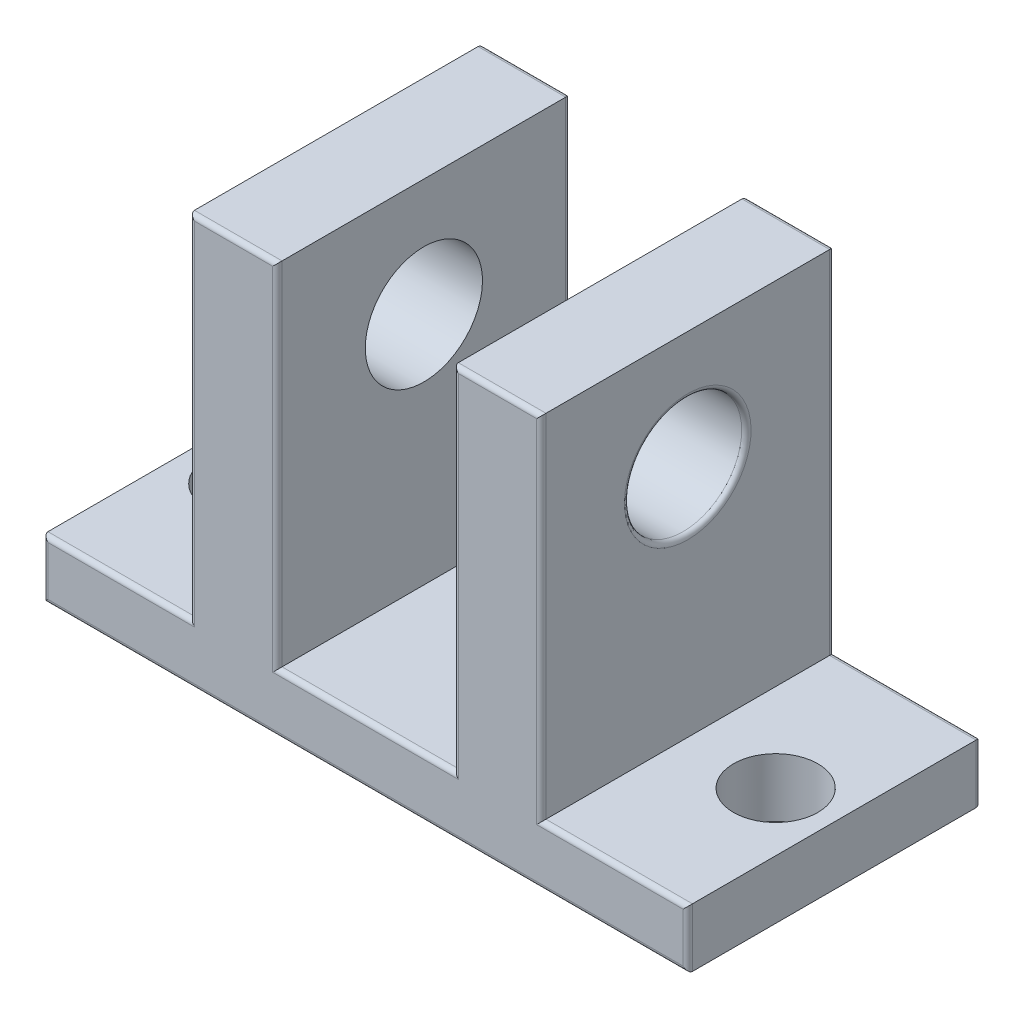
from build123d import *

# Parameters (mm, degrees)
BASE_EXTRUDE_DEPTH = 15.875
SKETCH2_R          = 3.175
CUT_EXTRUDE1_DEPTH = 39.396502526
SKETCH3_R          = 2.286
CUT_EXTRUDE3_DEPTH = 33.417667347
FILLET1_R          = 0.254


with BuildPart() as part:
    # Sketch1 → Base-Extrude (new body)
    with BuildSketch(Plane.XY):
        Polygon((-17.4625, 0), (17.4625, 0), (17.4625, 3.175), (9.525, 3.175), (9.525, 22.225), (4.7752, 22.225), (4.7752, 3.175), (-4.7752, 3.175), (-4.7752, 22.225), (-9.525, 22.225), (-9.525, 3.175), (-17.4625, 3.175), align=None)
    extrude(amount=BASE_EXTRUDE_DEPTH)

    # Sketch2 → Cut-Extrude1 (cut, through all)
    with BuildSketch(Plane(origin=(9.525, 0, 0), x_dir=(0, 0, -1), z_dir=(1, 0, 0))):
        with Locations(Location((-7.9375, 15.875, 0), (0, 0, 90))):
            Circle(SKETCH2_R)
    extrude(amount=-CUT_EXTRUDE1_DEPTH, mode=Mode.SUBTRACT)

    # Sketch3 → Cut-Extrude3 (cut, through all)
    with BuildSketch(Plane(origin=(0, 0, 0), x_dir=(1, 0, 0), z_dir=(0, 1, 0))):
        with Locations((-14.2875, -7.9375)):
            Circle(SKETCH3_R)
        with Locations((14.2875, -7.9375)):
            Circle(SKETCH3_R)
    extrude(amount=CUT_EXTRUDE3_DEPTH, mode=Mode.SUBTRACT)

    # Fillet1
    fillet1_edges = [part.edges().sort_by_distance(p)[0] for p in [
        (0, 0, 0),
        (0, 0, 15.875),
        (-17.4625, 1.5875, 0),
        (-17.4625, 1.5875, 15.875),
        (17.4625, 1.5875, 0),
        (13.49375, 3.175, 0),
        (9.525, 12.7, 0),
        (7.1501, 22.225, 0),
        (4.7752, 12.7, 0),
        (0, 3.175, 0),
        (-4.7752, 12.7, 0),
        (-7.1501, 22.225, 0),
        (-9.525, 12.7, 0),
        (-13.49375, 3.175, 0),
        (17.4625, 1.5875, 15.875),
        (13.49375, 3.175, 15.875),
        (9.525, 12.7, 15.875),
        (7.1501, 22.225, 15.875),
        (4.7752, 12.7, 15.875),
        (0, 3.175, 15.875),
        (-4.7752, 12.7, 15.875),
        (-7.1501, 22.225, 15.875),
        (-9.525, 12.7, 15.875),
        (-13.49375, 3.175, 15.875),
        (9.525, 12.7, 7.9375),
        (-9.525, 12.7, 7.9375),
    ]]
    fillet(fillet1_edges, radius=FILLET1_R)


solid = part.part
